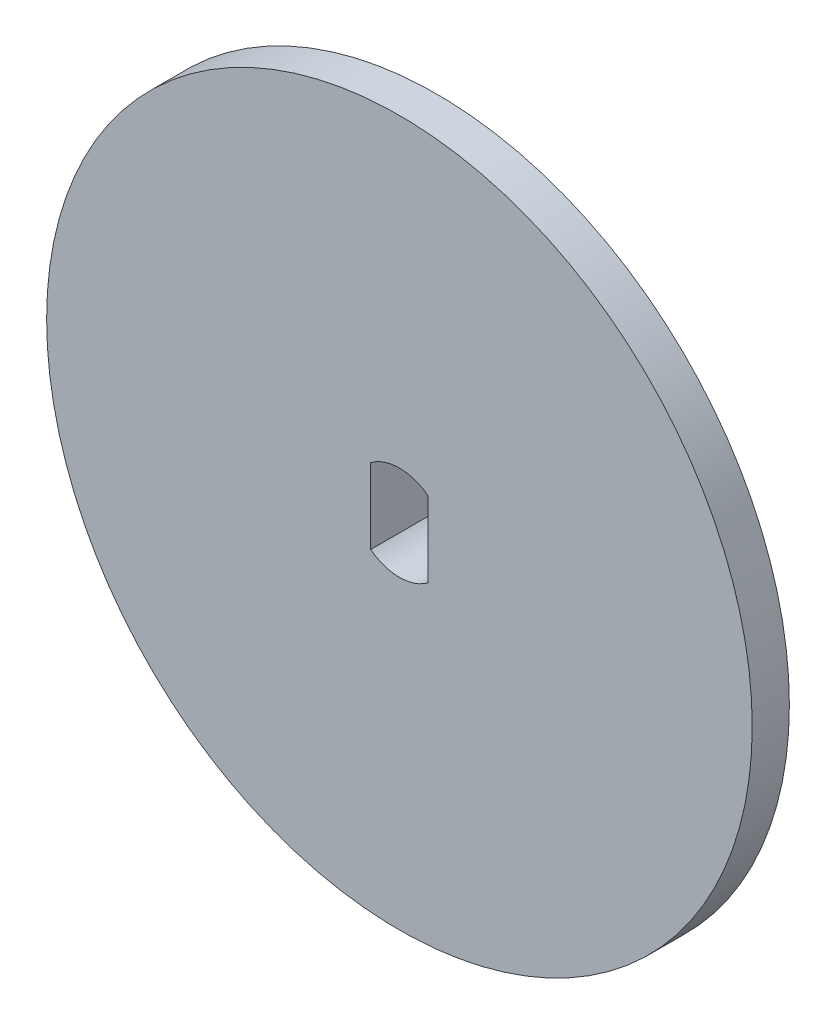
ISO-10303-21;
HEADER;
FILE_DESCRIPTION(('STEP AP214'),'2;1');
FILE_NAME('part.step','',(''),(''),'','','');
FILE_SCHEMA(('AUTOMOTIVE_DESIGN { 1 0 10303 214 1 1 1 1 }'));
ENDSEC;
DATA;
#1=APPLICATION_CONTEXT('core data for automotive mechanical design processes');
#2=APPLICATION_PROTOCOL_DEFINITION('international standard','automotive_design',2000,#1);
#3=PRODUCT_CONTEXT('',#1,'mechanical');
#4=PRODUCT('Part','Part','',(#3));
#5=PRODUCT_RELATED_PRODUCT_CATEGORY('part','',(#4));
#6=PRODUCT_DEFINITION_FORMATION('','',#4);
#7=PRODUCT_DEFINITION_CONTEXT('part definition',#1,'design');
#8=PRODUCT_DEFINITION('design','',#6,#7);
#9=PRODUCT_DEFINITION_SHAPE('','',#8);
#10=(LENGTH_UNIT() NAMED_UNIT(*) SI_UNIT(.MILLI.,.METRE.));
#11=(NAMED_UNIT(*) PLANE_ANGLE_UNIT() SI_UNIT($,.RADIAN.));
#12=(NAMED_UNIT(*) SI_UNIT($,.STERADIAN.) SOLID_ANGLE_UNIT());
#13=UNCERTAINTY_MEASURE_WITH_UNIT(LENGTH_MEASURE(1.E-05),#10,'distance_accuracy_value','');
#14=(GEOMETRIC_REPRESENTATION_CONTEXT(3) GLOBAL_UNCERTAINTY_ASSIGNED_CONTEXT((#13)) GLOBAL_UNIT_ASSIGNED_CONTEXT((#10,
#11,#12)) REPRESENTATION_CONTEXT('',''));
#15=CARTESIAN_POINT('',(0.,0.,0.));
#16=DIRECTION('',(0.,0.,1.));
#17=DIRECTION('',(1.,0.,0.));
#18=AXIS2_PLACEMENT_3D('',#15,#16,#17);
#19=CARTESIAN_POINT('',(0.,0.,0.));
#20=DIRECTION('',(0.,0.,1.));
#21=DIRECTION('',(1.,0.,0.));
#22=AXIS2_PLACEMENT_3D('',#19,#20,#21);
#23=PLANE('',#22);
#24=CARTESIAN_POINT('',(0.,0.,0.));
#25=DIRECTION('',(0.,0.,1.));
#26=DIRECTION('',(1.,0.,0.));
#27=AXIS2_PLACEMENT_3D('',#24,#25,#26);
#28=CIRCLE('',#27,6.3);
#29=CARTESIAN_POINT('',(6.3,0.,0.));
#30=VERTEX_POINT('',#29);
#31=EDGE_CURVE('E45',#30,#30,#28,.T.);
#32=ORIENTED_EDGE('',*,*,#31,.T.);
#33=EDGE_LOOP('',(#32));
#34=FACE_BOUND('',#33,.T.);
#35=CARTESIAN_POINT('',(0.,0.,0.));
#36=DIRECTION('',(0.,0.,-1.));
#37=DIRECTION('',(-1.,0.,0.));
#38=AXIS2_PLACEMENT_3D('',#35,#36,#37);
#39=CIRCLE('',#38,19.);
#40=CARTESIAN_POINT('',(-19.,0.,0.));
#41=VERTEX_POINT('',#40);
#42=EDGE_CURVE('E104',#41,#41,#39,.T.);
#43=ORIENTED_EDGE('',*,*,#42,.T.);
#44=EDGE_LOOP('',(#43));
#45=FACE_BOUND('',#44,.T.);
#46=ADVANCED_FACE('F37',(#34,#45),#23,.F.);
#47=CARTESIAN_POINT('',(0.,0.,2.));
#48=DIRECTION('',(0.,0.,-1.));
#49=DIRECTION('',(-1.,0.,0.));
#50=AXIS2_PLACEMENT_3D('',#47,#48,#49);
#51=PLANE('',#50);
#52=CARTESIAN_POINT('',(0.,0.,2.));
#53=DIRECTION('',(0.,0.,-1.));
#54=DIRECTION('',(-1.,0.,0.));
#55=AXIS2_PLACEMENT_3D('',#52,#53,#54);
#56=CIRCLE('',#55,19.);
#57=CARTESIAN_POINT('',(-19.,0.,2.));
#58=VERTEX_POINT('',#57);
#59=EDGE_CURVE('E100',#58,#58,#56,.T.);
#60=ORIENTED_EDGE('',*,*,#59,.F.);
#61=EDGE_LOOP('',(#60));
#62=FACE_BOUND('',#61,.T.);
#63=CARTESIAN_POINT('',(0.,0.,2.00000000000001));
#64=DIRECTION('',(0.,0.,-1.));
#65=DIRECTION('',(-1.,0.,0.));
#66=AXIS2_PLACEMENT_3D('',#63,#64,#65);
#67=CIRCLE('',#66,2.55);
#68=CARTESIAN_POINT('',(-1.55,-2.02484567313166,2.00000000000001));
#69=VERTEX_POINT('',#68);
#70=CARTESIAN_POINT('',(1.55,-2.02484567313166,2.00000000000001));
#71=VERTEX_POINT('',#70);
#72=EDGE_CURVE('E85',#69,#71,#67,.F.);
#73=ORIENTED_EDGE('',*,*,#72,.F.);
#74=DIRECTION('',(0.,-1.,0.));
#75=VECTOR('',#74,1.);
#76=CARTESIAN_POINT('',(-1.55,2.02484567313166,2.00000000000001));
#77=LINE('',#76,#75);
#78=CARTESIAN_POINT('',(-1.55,2.02484567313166,2.00000000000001));
#79=VERTEX_POINT('',#78);
#80=EDGE_CURVE('E52',#79,#69,#77,.T.);
#81=ORIENTED_EDGE('',*,*,#80,.F.);
#82=CARTESIAN_POINT('',(0.,0.,2.00000000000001));
#83=DIRECTION('',(0.,0.,-1.));
#84=DIRECTION('',(-1.,0.,0.));
#85=AXIS2_PLACEMENT_3D('',#82,#83,#84);
#86=CIRCLE('',#85,2.55);
#87=CARTESIAN_POINT('',(1.55,2.02484567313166,2.00000000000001));
#88=VERTEX_POINT('',#87);
#89=EDGE_CURVE('E11',#88,#79,#86,.F.);
#90=ORIENTED_EDGE('',*,*,#89,.F.);
#91=DIRECTION('',(0.,1.,0.));
#92=VECTOR('',#91,1.);
#93=CARTESIAN_POINT('',(1.55,2.02484567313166,2.00000000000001));
#94=LINE('',#93,#92);
#95=EDGE_CURVE('E77',#71,#88,#94,.T.);
#96=ORIENTED_EDGE('',*,*,#95,.F.);
#97=EDGE_LOOP('',(#73,#81,#90,#96));
#98=FACE_BOUND('',#97,.T.);
#99=ADVANCED_FACE('F76',(#62,#98),#51,.F.);
#100=CARTESIAN_POINT('',(0.,0.,2.));
#101=DIRECTION('',(0.,0.,-1.));
#102=DIRECTION('',(-1.,0.,0.));
#103=AXIS2_PLACEMENT_3D('',#100,#101,#102);
#104=CYLINDRICAL_SURFACE('',#103,19.);
#105=ORIENTED_EDGE('',*,*,#59,.T.);
#106=EDGE_LOOP('',(#105));
#107=FACE_BOUND('',#106,.T.);
#108=ORIENTED_EDGE('',*,*,#42,.F.);
#109=EDGE_LOOP('',(#108));
#110=FACE_BOUND('',#109,.T.);
#111=ADVANCED_FACE('F127',(#107,#110),#104,.T.);
#112=CARTESIAN_POINT('',(0.,0.,-4.));
#113=DIRECTION('',(0.,0.,-1.));
#114=DIRECTION('',(-1.,0.,0.));
#115=AXIS2_PLACEMENT_3D('',#112,#113,#114);
#116=PLANE('',#115);
#117=CARTESIAN_POINT('',(0.,0.,-4.));
#118=DIRECTION('',(0.,0.,-1.));
#119=DIRECTION('',(-1.,0.,0.));
#120=AXIS2_PLACEMENT_3D('',#117,#118,#119);
#121=CIRCLE('',#120,4.3);
#122=CARTESIAN_POINT('',(-4.3,0.,-4.));
#123=VERTEX_POINT('',#122);
#124=EDGE_CURVE('E91',#123,#123,#121,.T.);
#125=ORIENTED_EDGE('',*,*,#124,.T.);
#126=EDGE_LOOP('',(#125));
#127=FACE_BOUND('',#126,.T.);
#128=DIRECTION('',(0.,1.,0.));
#129=VECTOR('',#128,1.);
#130=CARTESIAN_POINT('',(-1.55,-2.02484567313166,-4.));
#131=LINE('',#130,#129);
#132=CARTESIAN_POINT('',(-1.55,-2.02484567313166,-4.));
#133=VERTEX_POINT('',#132);
#134=CARTESIAN_POINT('',(-1.55,2.02484567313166,-4.));
#135=VERTEX_POINT('',#134);
#136=EDGE_CURVE('E132',#133,#135,#131,.T.);
#137=ORIENTED_EDGE('',*,*,#136,.F.);
#138=CARTESIAN_POINT('',(0.,0.,-4.));
#139=DIRECTION('',(0.,0.,-1.));
#140=DIRECTION('',(-1.,0.,0.));
#141=AXIS2_PLACEMENT_3D('',#138,#139,#140);
#142=CIRCLE('',#141,2.55);
#143=CARTESIAN_POINT('',(1.55,-2.02484567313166,-4.));
#144=VERTEX_POINT('',#143);
#145=EDGE_CURVE('E84',#144,#133,#142,.T.);
#146=ORIENTED_EDGE('',*,*,#145,.F.);
#147=DIRECTION('',(0.,-1.,0.));
#148=VECTOR('',#147,1.);
#149=CARTESIAN_POINT('',(1.55,2.02484567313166,-4.));
#150=LINE('',#149,#148);
#151=CARTESIAN_POINT('',(1.55,2.02484567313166,-4.));
#152=VERTEX_POINT('',#151);
#153=EDGE_CURVE('E96',#152,#144,#150,.T.);
#154=ORIENTED_EDGE('',*,*,#153,.F.);
#155=CARTESIAN_POINT('',(0.,0.,-4.));
#156=DIRECTION('',(0.,0.,-1.));
#157=DIRECTION('',(-1.,0.,0.));
#158=AXIS2_PLACEMENT_3D('',#155,#156,#157);
#159=CIRCLE('',#158,2.55);
#160=EDGE_CURVE('E89',#135,#152,#159,.T.);
#161=ORIENTED_EDGE('',*,*,#160,.F.);
#162=EDGE_LOOP('',(#137,#146,#154,#161));
#163=FACE_BOUND('',#162,.T.);
#164=ADVANCED_FACE('F121',(#127,#163),#116,.T.);
#165=CARTESIAN_POINT('',(0.,0.,-4.));
#166=DIRECTION('',(0.,0.,1.));
#167=DIRECTION('',(1.,0.,0.));
#168=AXIS2_PLACEMENT_3D('',#165,#166,#167);
#169=CYLINDRICAL_SURFACE('',#168,4.3);
#170=CARTESIAN_POINT('',(0.,0.,-2.));
#171=DIRECTION('',(0.,0.,1.));
#172=DIRECTION('',(1.,0.,0.));
#173=AXIS2_PLACEMENT_3D('',#170,#171,#172);
#174=CIRCLE('',#173,4.3);
#175=CARTESIAN_POINT('',(4.3,0.,-2.));
#176=VERTEX_POINT('',#175);
#177=EDGE_CURVE('E103',#176,#176,#174,.F.);
#178=ORIENTED_EDGE('',*,*,#177,.T.);
#179=EDGE_LOOP('',(#178));
#180=FACE_BOUND('',#179,.T.);
#181=ORIENTED_EDGE('',*,*,#124,.F.);
#182=EDGE_LOOP('',(#181));
#183=FACE_BOUND('',#182,.T.);
#184=ADVANCED_FACE('F118',(#180,#183),#169,.T.);
#185=CARTESIAN_POINT('',(1.55,2.02484567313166,5.));
#186=DIRECTION('',(1.,0.,0.));
#187=DIRECTION('',(0.,0.,-1.));
#188=AXIS2_PLACEMENT_3D('',#185,#186,#187);
#189=PLANE('',#188);
#190=DIRECTION('',(0.,0.,-1.));
#191=VECTOR('',#190,1.);
#192=CARTESIAN_POINT('',(1.55,-2.02484567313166,5.));
#193=LINE('',#192,#191);
#194=EDGE_CURVE('E83',#71,#144,#193,.T.);
#195=ORIENTED_EDGE('',*,*,#194,.F.);
#196=ORIENTED_EDGE('',*,*,#95,.T.);
#197=DIRECTION('',(0.,0.,-1.));
#198=VECTOR('',#197,1.);
#199=CARTESIAN_POINT('',(1.55,2.02484567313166,5.));
#200=LINE('',#199,#198);
#201=EDGE_CURVE('E59',#88,#152,#200,.T.);
#202=ORIENTED_EDGE('',*,*,#201,.T.);
#203=ORIENTED_EDGE('',*,*,#153,.T.);
#204=EDGE_LOOP('',(#195,#196,#202,#203));
#205=FACE_BOUND('',#204,.T.);
#206=ADVANCED_FACE('F82',(#205),#189,.F.);
#207=CARTESIAN_POINT('',(0.,0.,5.));
#208=DIRECTION('',(0.,0.,-1.));
#209=DIRECTION('',(-1.,0.,0.));
#210=AXIS2_PLACEMENT_3D('',#207,#208,#209);
#211=CYLINDRICAL_SURFACE('',#210,2.55);
#212=DIRECTION('',(0.,0.,-1.));
#213=VECTOR('',#212,1.);
#214=CARTESIAN_POINT('',(-1.55,-2.02484567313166,5.));
#215=LINE('',#214,#213);
#216=EDGE_CURVE('E93',#69,#133,#215,.T.);
#217=ORIENTED_EDGE('',*,*,#216,.F.);
#218=ORIENTED_EDGE('',*,*,#72,.T.);
#219=ORIENTED_EDGE('',*,*,#194,.T.);
#220=ORIENTED_EDGE('',*,*,#145,.T.);
#221=EDGE_LOOP('',(#217,#218,#219,#220));
#222=FACE_BOUND('',#221,.T.);
#223=ADVANCED_FACE('F143',(#222),#211,.F.);
#224=CARTESIAN_POINT('',(-1.55,2.02484567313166,5.));
#225=DIRECTION('',(-1.,0.,0.));
#226=DIRECTION('',(0.,0.,1.));
#227=AXIS2_PLACEMENT_3D('',#224,#225,#226);
#228=PLANE('',#227);
#229=DIRECTION('',(0.,0.,-1.));
#230=VECTOR('',#229,1.);
#231=CARTESIAN_POINT('',(-1.55,2.02484567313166,5.));
#232=LINE('',#231,#230);
#233=EDGE_CURVE('E107',#79,#135,#232,.T.);
#234=ORIENTED_EDGE('',*,*,#233,.F.);
#235=ORIENTED_EDGE('',*,*,#80,.T.);
#236=ORIENTED_EDGE('',*,*,#216,.T.);
#237=ORIENTED_EDGE('',*,*,#136,.T.);
#238=EDGE_LOOP('',(#234,#235,#236,#237));
#239=FACE_BOUND('',#238,.T.);
#240=ADVANCED_FACE('F141',(#239),#228,.F.);
#241=CARTESIAN_POINT('',(0.,0.,5.));
#242=DIRECTION('',(0.,0.,-1.));
#243=DIRECTION('',(-1.,0.,0.));
#244=AXIS2_PLACEMENT_3D('',#241,#242,#243);
#245=CYLINDRICAL_SURFACE('',#244,2.55);
#246=ORIENTED_EDGE('',*,*,#201,.F.);
#247=ORIENTED_EDGE('',*,*,#89,.T.);
#248=ORIENTED_EDGE('',*,*,#233,.T.);
#249=ORIENTED_EDGE('',*,*,#160,.T.);
#250=EDGE_LOOP('',(#246,#247,#248,#249));
#251=FACE_BOUND('',#250,.T.);
#252=ADVANCED_FACE('F87',(#251),#245,.F.);
#253=CARTESIAN_POINT('',(0.,0.,-2.));
#254=DIRECTION('',(0.,0.,1.));
#255=DIRECTION('',(1.,0.,0.));
#256=AXIS2_PLACEMENT_3D('',#253,#254,#255);
#257=TOROIDAL_SURFACE('',#256,6.3,2.);
#258=ORIENTED_EDGE('',*,*,#31,.F.);
#259=EDGE_LOOP('',(#258));
#260=FACE_BOUND('',#259,.T.);
#261=ORIENTED_EDGE('',*,*,#177,.F.);
#262=EDGE_LOOP('',(#261));
#263=FACE_BOUND('',#262,.T.);
#264=ADVANCED_FACE('F39',(#260,#263),#257,.F.);
#265=CLOSED_SHELL('',(#46,#99,#111,#164,#184,#206,#223,#240,#252,#264));
#266=MANIFOLD_SOLID_BREP('B2',#265);
#267=ADVANCED_BREP_SHAPE_REPRESENTATION('',(#18,#266),#14);
#268=SHAPE_DEFINITION_REPRESENTATION(#9,#267);
ENDSEC;
END-ISO-10303-21;
